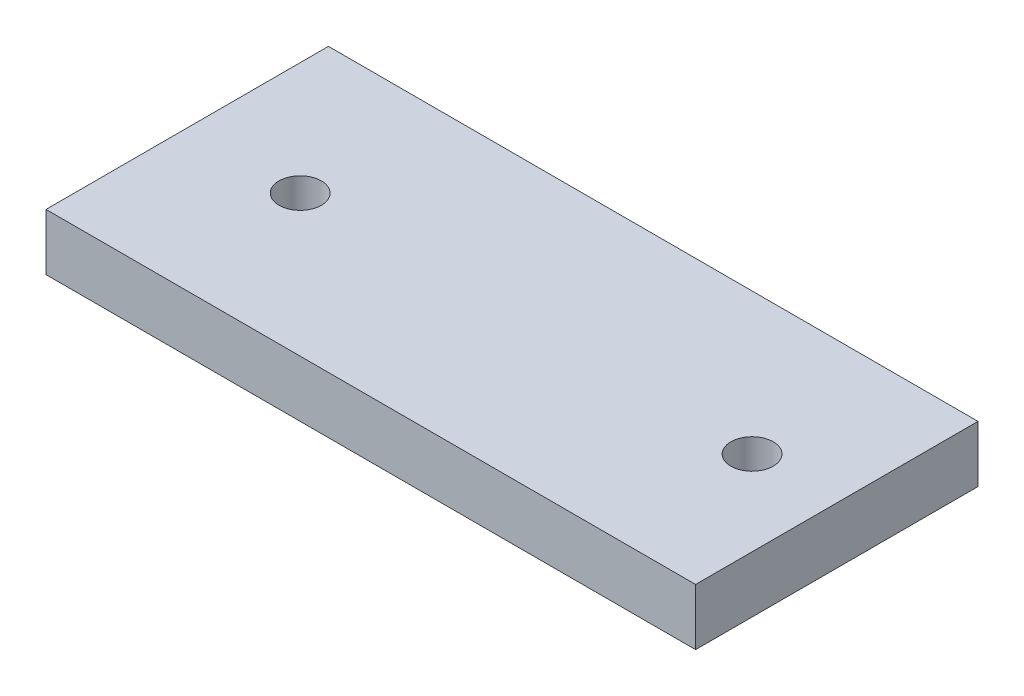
from build123d import *

# Parameters (mm, degrees)
SKETCH1_W      = 146.05
SKETCH1_H      = 63.5
SKETCH1_R      = 4.7625
EXTRUDE1_DEPTH = 12.7


with BuildPart() as part:
    # Sketch1 → Extrude1 (new body)
    with BuildSketch(Plane(origin=(0, 0, 0), x_dir=(1, 0, 0), z_dir=(0, 1, 0))):
        with Locations((-3.175, 0)):
            Rectangle(SKETCH1_W, SKETCH1_H)
        with Locations(Location((50.8, 0, 0), (0, 0, 270))):
            Circle(SKETCH1_R, mode=Mode.SUBTRACT)
        with Locations(Location((-50.8, 0, 0), (0, 0, 270))):
            Circle(SKETCH1_R, mode=Mode.SUBTRACT)
    extrude(amount=EXTRUDE1_DEPTH)


solid = part.part
